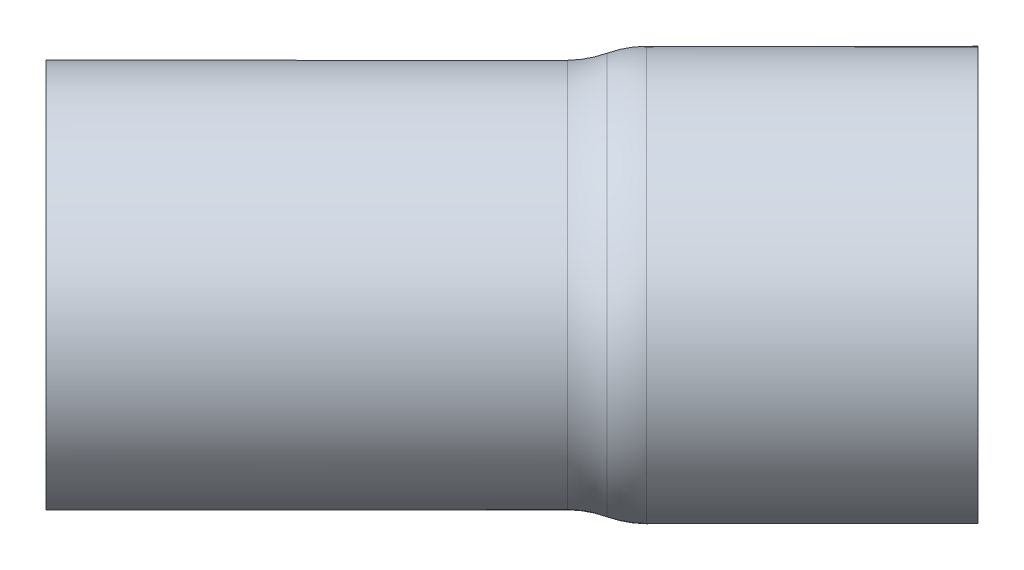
ISO-10303-21;
HEADER;
FILE_DESCRIPTION(('STEP AP214'),'2;1');
FILE_NAME('part.step','',(''),(''),'','','');
FILE_SCHEMA(('AUTOMOTIVE_DESIGN { 1 0 10303 214 1 1 1 1 }'));
ENDSEC;
DATA;
#1=APPLICATION_CONTEXT('core data for automotive mechanical design processes');
#2=APPLICATION_PROTOCOL_DEFINITION('international standard','automotive_design',2000,#1);
#3=PRODUCT_CONTEXT('',#1,'mechanical');
#4=PRODUCT('Part','Part','',(#3));
#5=PRODUCT_RELATED_PRODUCT_CATEGORY('part','',(#4));
#6=PRODUCT_DEFINITION_FORMATION('','',#4);
#7=PRODUCT_DEFINITION_CONTEXT('part definition',#1,'design');
#8=PRODUCT_DEFINITION('design','',#6,#7);
#9=PRODUCT_DEFINITION_SHAPE('','',#8);
#10=(LENGTH_UNIT() NAMED_UNIT(*) SI_UNIT(.MILLI.,.METRE.));
#11=(NAMED_UNIT(*) PLANE_ANGLE_UNIT() SI_UNIT($,.RADIAN.));
#12=(NAMED_UNIT(*) SI_UNIT($,.STERADIAN.) SOLID_ANGLE_UNIT());
#13=UNCERTAINTY_MEASURE_WITH_UNIT(LENGTH_MEASURE(1.E-05),#10,'distance_accuracy_value','');
#14=(GEOMETRIC_REPRESENTATION_CONTEXT(3) GLOBAL_UNCERTAINTY_ASSIGNED_CONTEXT((#13)) GLOBAL_UNIT_ASSIGNED_CONTEXT((#10,
#11,#12)) REPRESENTATION_CONTEXT('',''));
#15=CARTESIAN_POINT('',(0.,0.,0.));
#16=DIRECTION('',(0.,0.,1.));
#17=DIRECTION('',(1.,0.,0.));
#18=AXIS2_PLACEMENT_3D('',#15,#16,#17);
#19=CARTESIAN_POINT('',(88.2325464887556,-187.470393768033,-482.85222730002));
#20=DIRECTION('',(-0.707106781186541,6.4002076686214E-10,0.707106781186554));
#21=DIRECTION('',(0.707106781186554,0.,0.707106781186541));
#22=AXIS2_PLACEMENT_3D('',#19,#20,#21);
#23=CYLINDRICAL_SURFACE('',#22,2.4271478);
#24=CARTESIAN_POINT('',(97.6836913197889,-187.470393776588,-492.303372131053));
#25=DIRECTION('',(-0.707106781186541,6.4002076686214E-10,0.707106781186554));
#26=DIRECTION('',(0.707106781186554,0.,0.707106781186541));
#27=AXIS2_PLACEMENT_3D('',#24,#25,#26);
#28=CIRCLE('',#27,2.4271478);
#29=CARTESIAN_POINT('',(99.3999439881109,-187.470393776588,-490.587119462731));
#30=VERTEX_POINT('',#29);
#31=EDGE_CURVE('E18',#30,#30,#28,.F.);
#32=ORIENTED_EDGE('',*,*,#31,.T.);
#33=EDGE_LOOP('',(#32));
#34=FACE_BOUND('',#33,.T.);
#35=CARTESIAN_POINT('',(94.3217169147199,-187.470393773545,-488.941397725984));
#36=DIRECTION('',(-0.707106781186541,6.4002076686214E-10,0.707106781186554));
#37=DIRECTION('',(-5.61384370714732E-10,-1.,3.43750225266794E-10));
#38=AXIS2_PLACEMENT_3D('',#35,#36,#37);
#39=CIRCLE('',#38,2.4271478);
#40=CARTESIAN_POINT('',(94.3217169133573,-189.897541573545,-488.94139772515));
#41=VERTEX_POINT('',#40);
#42=EDGE_CURVE('E31',#41,#41,#39,.T.);
#43=ORIENTED_EDGE('',*,*,#42,.T.);
#44=EDGE_LOOP('',(#43));
#45=FACE_BOUND('',#44,.T.);
#46=ADVANCED_FACE('F15',(#34,#45),#23,.F.);
#47=CARTESIAN_POINT('',(97.6836913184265,-189.897541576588,-492.303372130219));
#48=DIRECTION('',(-0.707106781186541,6.4002076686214E-10,0.707106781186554));
#49=DIRECTION('',(0.707106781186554,0.,0.707106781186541));
#50=AXIS2_PLACEMENT_3D('',#47,#48,#49);
#51=PLANE('',#50);
#52=ORIENTED_EDGE('',*,*,#31,.F.);
#53=EDGE_LOOP('',(#52));
#54=FACE_BOUND('',#53,.T.);
#55=CARTESIAN_POINT('',(97.6836913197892,-187.470393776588,-492.303372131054));
#56=DIRECTION('',(-0.707106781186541,6.4002076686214E-10,0.707106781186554));
#57=DIRECTION('',(0.707106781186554,0.,0.707106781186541));
#58=AXIS2_PLACEMENT_3D('',#55,#56,#57);
#59=CIRCLE('',#58,3.4246058);
#60=CARTESIAN_POINT('',(100.10525330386,-187.470393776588,-489.881810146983));
#61=VERTEX_POINT('',#60);
#62=EDGE_CURVE('E35',#61,#61,#59,.T.);
#63=ORIENTED_EDGE('',*,*,#62,.F.);
#64=EDGE_LOOP('',(#63));
#65=FACE_BOUND('',#64,.T.);
#66=ADVANCED_FACE('F50',(#54,#65),#51,.F.);
#67=CARTESIAN_POINT('',(94.3217169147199,-187.470393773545,-488.941397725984));
#68=DIRECTION('',(-0.707106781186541,6.4002076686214E-10,0.707106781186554));
#69=DIRECTION('',(-5.61388835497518E-10,-1.,3.43737213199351E-10));
#70=AXIS2_PLACEMENT_3D('',#67,#68,#69);
#71=TOROIDAL_SURFACE('',#70,1.76217579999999,0.664972);
#72=ORIENTED_EDGE('',*,*,#42,.F.);
#73=EDGE_LOOP('',(#72));
#74=FACE_BOUND('',#73,.T.);
#75=CARTESIAN_POINT('',(94.1612945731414,-187.4703937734,-488.780975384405));
#76=DIRECTION('',(-0.707106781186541,6.4002076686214E-10,0.707106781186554));
#77=DIRECTION('',(-5.61395806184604E-10,-1.,3.43728564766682E-10));
#78=AXIS2_PLACEMENT_3D('',#75,#76,#77);
#79=CIRCLE('',#78,2.38724948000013);
#80=CARTESIAN_POINT('',(94.1612945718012,-189.8576432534,-488.780975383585));
#81=VERTEX_POINT('',#80);
#82=EDGE_CURVE('E37',#81,#81,#79,.F.);
#83=ORIENTED_EDGE('',*,*,#82,.F.);
#84=EDGE_LOOP('',(#83));
#85=FACE_BOUND('',#84,.T.);
#86=ADVANCED_FACE('F53',(#74,#85),#71,.F.);
#87=CARTESIAN_POINT('',(88.2325464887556,-187.470393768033,-482.85222730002));
#88=DIRECTION('',(-0.707106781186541,6.4002076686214E-10,0.707106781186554));
#89=DIRECTION('',(0.707106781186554,0.,0.707106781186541));
#90=AXIS2_PLACEMENT_3D('',#87,#88,#89);
#91=CYLINDRICAL_SURFACE('',#90,3.4246058);
#92=ORIENTED_EDGE('',*,*,#62,.T.);
#93=EDGE_LOOP('',(#92));
#94=FACE_BOUND('',#93,.T.);
#95=CARTESIAN_POINT('',(94.3217169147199,-187.470393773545,-488.941397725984));
#96=DIRECTION('',(-0.707106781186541,6.4002076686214E-10,0.707106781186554));
#97=DIRECTION('',(-5.61387701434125E-10,-1.,3.43738678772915E-10));
#98=AXIS2_PLACEMENT_3D('',#95,#96,#97);
#99=CIRCLE('',#98,3.42460579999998);
#100=CARTESIAN_POINT('',(94.3217169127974,-190.894999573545,-488.941397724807));
#101=VERTEX_POINT('',#100);
#102=EDGE_CURVE('E41',#101,#101,#99,.T.);
#103=ORIENTED_EDGE('',*,*,#102,.F.);
#104=EDGE_LOOP('',(#103));
#105=FACE_BOUND('',#104,.T.);
#106=ADVANCED_FACE('F59',(#94,#105),#91,.T.);
#107=CARTESIAN_POINT('',(93.5196052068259,-187.470393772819,-488.13928601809));
#108=DIRECTION('',(-0.707106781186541,6.4002076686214E-10,0.707106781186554));
#109=DIRECTION('',(-5.61395130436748E-10,-1.,3.43730918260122E-10));
#110=AXIS2_PLACEMENT_3D('',#107,#108,#109);
#111=TOROIDAL_SURFACE('',#110,4.88754420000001,2.659888);
#112=ORIENTED_EDGE('',*,*,#82,.T.);
#113=EDGE_LOOP('',(#112));
#114=FACE_BOUND('',#113,.T.);
#115=CARTESIAN_POINT('',(93.5196052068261,-187.470393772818,-488.139286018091));
#116=DIRECTION('',(-0.707106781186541,6.4002076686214E-10,0.707106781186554));
#117=DIRECTION('',(0.707106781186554,0.,0.707106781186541));
#118=AXIS2_PLACEMENT_3D('',#115,#116,#117);
#119=CIRCLE('',#118,2.2276562);
#120=CARTESIAN_POINT('',(95.0947960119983,-187.470393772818,-486.564095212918));
#121=VERTEX_POINT('',#120);
#122=EDGE_CURVE('E84',#121,#121,#119,.T.);
#123=ORIENTED_EDGE('',*,*,#122,.T.);
#124=EDGE_LOOP('',(#123));
#125=FACE_BOUND('',#124,.T.);
#126=ADVANCED_FACE('F91',(#114,#125),#111,.T.);
#127=CARTESIAN_POINT('',(94.3217169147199,-187.470393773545,-488.941397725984));
#128=DIRECTION('',(-0.707106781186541,6.4002076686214E-10,0.707106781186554));
#129=DIRECTION('',(-5.61384897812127E-10,-1.,3.43741150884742E-10));
#130=AXIS2_PLACEMENT_3D('',#127,#128,#129);
#131=TOROIDAL_SURFACE('',#130,1.76217579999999,1.66243);
#132=ORIENTED_EDGE('',*,*,#102,.T.);
#133=EDGE_LOOP('',(#132));
#134=FACE_BOUND('',#133,.T.);
#135=CARTESIAN_POINT('',(93.9206610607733,-187.470393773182,-488.540341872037));
#136=DIRECTION('',(-0.707106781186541,6.4002076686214E-10,0.707106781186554));
#137=DIRECTION('',(-5.61387458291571E-10,-1.,3.43732843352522E-10));
#138=AXIS2_PLACEMENT_3D('',#135,#136,#137);
#139=CIRCLE('',#138,3.32486000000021);
#140=CARTESIAN_POINT('',(93.9206610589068,-190.795253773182,-488.540341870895));
#141=VERTEX_POINT('',#140);
#142=EDGE_CURVE('E34',#141,#141,#139,.F.);
#143=ORIENTED_EDGE('',*,*,#142,.T.);
#144=EDGE_LOOP('',(#143));
#145=FACE_BOUND('',#144,.T.);
#146=ADVANCED_FACE('F88',(#134,#145),#131,.T.);
#147=CARTESIAN_POINT('',(88.2325464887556,-187.470393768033,-482.85222730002));
#148=DIRECTION('',(-0.707106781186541,6.4002076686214E-10,0.707106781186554));
#149=DIRECTION('',(0.707106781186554,0.,0.707106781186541));
#150=AXIS2_PLACEMENT_3D('',#147,#148,#149);
#151=CYLINDRICAL_SURFACE('',#150,2.2276562);
#152=ORIENTED_EDGE('',*,*,#122,.F.);
#153=EDGE_LOOP('',(#152));
#154=FACE_BOUND('',#153,.T.);
#155=CARTESIAN_POINT('',(88.2325464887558,-187.470393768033,-482.85222730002));
#156=DIRECTION('',(-0.707106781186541,6.4002076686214E-10,0.707106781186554));
#157=DIRECTION('',(0.707106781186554,0.,0.707106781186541));
#158=AXIS2_PLACEMENT_3D('',#155,#156,#157);
#159=CIRCLE('',#158,2.2276562);
#160=CARTESIAN_POINT('',(89.807737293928,-187.470393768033,-481.277036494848));
#161=VERTEX_POINT('',#160);
#162=EDGE_CURVE('E27',#161,#161,#159,.T.);
#163=ORIENTED_EDGE('',*,*,#162,.T.);
#164=EDGE_LOOP('',(#163));
#165=FACE_BOUND('',#164,.T.);
#166=ADVANCED_FACE('F77',(#154,#165),#151,.F.);
#167=CARTESIAN_POINT('',(93.5196052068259,-187.470393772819,-488.13928601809));
#168=DIRECTION('',(-0.707106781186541,6.4002076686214E-10,0.707106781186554));
#169=DIRECTION('',(-5.61388031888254E-10,-1.,3.43738016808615E-10));
#170=AXIS2_PLACEMENT_3D('',#167,#168,#169);
#171=TOROIDAL_SURFACE('',#170,4.88754420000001,1.66243);
#172=ORIENTED_EDGE('',*,*,#142,.F.);
#173=EDGE_LOOP('',(#172));
#174=FACE_BOUND('',#173,.T.);
#175=CARTESIAN_POINT('',(93.5196052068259,-187.470393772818,-488.13928601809));
#176=DIRECTION('',(-0.707106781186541,6.4002076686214E-10,0.707106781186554));
#177=DIRECTION('',(0.707106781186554,0.,0.707106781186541));
#178=AXIS2_PLACEMENT_3D('',#175,#176,#177);
#179=CIRCLE('',#178,3.2251142);
#180=CARTESIAN_POINT('',(95.800105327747,-187.470393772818,-485.858785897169));
#181=VERTEX_POINT('',#180);
#182=EDGE_CURVE('E22',#181,#181,#179,.T.);
#183=ORIENTED_EDGE('',*,*,#182,.F.);
#184=EDGE_LOOP('',(#183));
#185=FACE_BOUND('',#184,.T.);
#186=ADVANCED_FACE('F70',(#174,#185),#171,.F.);
#187=CARTESIAN_POINT('',(88.232546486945,-190.695507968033,-482.852227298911));
#188=DIRECTION('',(0.707106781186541,-6.4002076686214E-10,-0.707106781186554));
#189=DIRECTION('',(-0.707106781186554,0.,-0.707106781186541));
#190=AXIS2_PLACEMENT_3D('',#187,#188,#189);
#191=PLANE('',#190);
#192=ORIENTED_EDGE('',*,*,#162,.F.);
#193=EDGE_LOOP('',(#192));
#194=FACE_BOUND('',#193,.T.);
#195=CARTESIAN_POINT('',(88.2325464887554,-187.470393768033,-482.85222730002));
#196=DIRECTION('',(-0.707106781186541,6.4002076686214E-10,0.707106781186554));
#197=DIRECTION('',(0.707106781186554,0.,0.707106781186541));
#198=AXIS2_PLACEMENT_3D('',#195,#196,#197);
#199=CIRCLE('',#198,3.2251142);
#200=CARTESIAN_POINT('',(90.5130466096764,-187.470393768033,-480.571727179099));
#201=VERTEX_POINT('',#200);
#202=EDGE_CURVE('E10',#201,#201,#199,.F.);
#203=ORIENTED_EDGE('',*,*,#202,.F.);
#204=EDGE_LOOP('',(#203));
#205=FACE_BOUND('',#204,.T.);
#206=ADVANCED_FACE('F64',(#194,#205),#191,.F.);
#207=CARTESIAN_POINT('',(88.2325464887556,-187.470393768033,-482.85222730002));
#208=DIRECTION('',(-0.707106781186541,6.4002076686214E-10,0.707106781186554));
#209=DIRECTION('',(0.707106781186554,0.,0.707106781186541));
#210=AXIS2_PLACEMENT_3D('',#207,#208,#209);
#211=CYLINDRICAL_SURFACE('',#210,3.2251142);
#212=ORIENTED_EDGE('',*,*,#182,.T.);
#213=EDGE_LOOP('',(#212));
#214=FACE_BOUND('',#213,.T.);
#215=ORIENTED_EDGE('',*,*,#202,.T.);
#216=EDGE_LOOP('',(#215));
#217=FACE_BOUND('',#216,.T.);
#218=ADVANCED_FACE('F62',(#214,#217),#211,.T.);
#219=CLOSED_SHELL('',(#46,#66,#86,#106,#126,#146,#166,#186,#206,#218));
#220=MANIFOLD_SOLID_BREP('B1',#219);
#221=ADVANCED_BREP_SHAPE_REPRESENTATION('',(#18,#220),#14);
#222=SHAPE_DEFINITION_REPRESENTATION(#9,#221);
ENDSEC;
END-ISO-10303-21;
